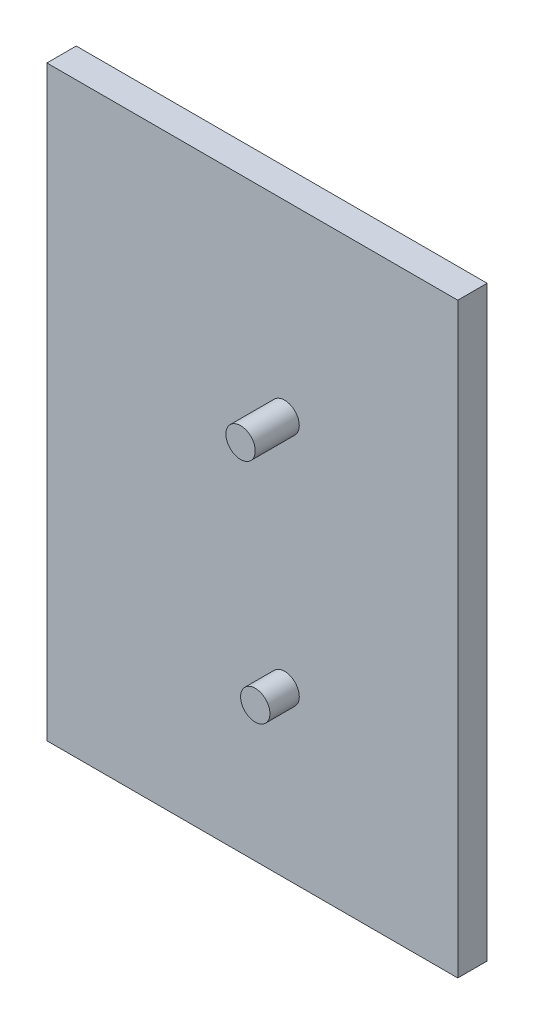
ISO-10303-21;
HEADER;
FILE_DESCRIPTION(('STEP AP214'),'2;1');
FILE_NAME('part.step','',(''),(''),'','','');
FILE_SCHEMA(('AUTOMOTIVE_DESIGN { 1 0 10303 214 1 1 1 1 }'));
ENDSEC;
DATA;
#1=APPLICATION_CONTEXT('core data for automotive mechanical design processes');
#2=APPLICATION_PROTOCOL_DEFINITION('international standard','automotive_design',2000,#1);
#3=PRODUCT_CONTEXT('',#1,'mechanical');
#4=PRODUCT('Part','Part','',(#3));
#5=PRODUCT_RELATED_PRODUCT_CATEGORY('part','',(#4));
#6=PRODUCT_DEFINITION_FORMATION('','',#4);
#7=PRODUCT_DEFINITION_CONTEXT('part definition',#1,'design');
#8=PRODUCT_DEFINITION('design','',#6,#7);
#9=PRODUCT_DEFINITION_SHAPE('','',#8);
#10=(LENGTH_UNIT() NAMED_UNIT(*) SI_UNIT(.MILLI.,.METRE.));
#11=(NAMED_UNIT(*) PLANE_ANGLE_UNIT() SI_UNIT($,.RADIAN.));
#12=(NAMED_UNIT(*) SI_UNIT($,.STERADIAN.) SOLID_ANGLE_UNIT());
#13=UNCERTAINTY_MEASURE_WITH_UNIT(LENGTH_MEASURE(1.E-05),#10,'distance_accuracy_value','');
#14=(GEOMETRIC_REPRESENTATION_CONTEXT(3) GLOBAL_UNCERTAINTY_ASSIGNED_CONTEXT((#13)) GLOBAL_UNIT_ASSIGNED_CONTEXT((#10,
#11,#12)) REPRESENTATION_CONTEXT('',''));
#15=CARTESIAN_POINT('',(0.,0.,0.));
#16=DIRECTION('',(0.,0.,1.));
#17=DIRECTION('',(1.,0.,0.));
#18=AXIS2_PLACEMENT_3D('',#15,#16,#17);
#19=CARTESIAN_POINT('',(-397.999998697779,-276.999997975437,-62.5));
#20=DIRECTION('',(0.,0.,1.));
#21=DIRECTION('',(1.,0.,0.));
#22=AXIS2_PLACEMENT_3D('',#19,#20,#21);
#23=PLANE('',#22);
#24=CARTESIAN_POINT('',(7.00001563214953,402.999993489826,-62.5));
#25=DIRECTION('',(0.,0.,1.));
#26=DIRECTION('',(1.,0.,0.));
#27=AXIS2_PLACEMENT_3D('',#24,#25,#26);
#28=CIRCLE('',#27,25.);
#29=CARTESIAN_POINT('',(32.0000156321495,402.999993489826,-62.5));
#30=VERTEX_POINT('',#29);
#31=EDGE_CURVE('E146',#30,#30,#28,.T.);
#32=ORIENTED_EDGE('',*,*,#31,.F.);
#33=EDGE_LOOP('',(#32));
#34=FACE_BOUND('',#33,.T.);
#35=DIRECTION('',(-2.10734241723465E-08,-1.,0.));
#36=VECTOR('',#35,1.);
#37=CARTESIAN_POINT('',(-397.999977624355,723.000002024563,-62.5));
#38=LINE('',#37,#36);
#39=CARTESIAN_POINT('',(-397.999977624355,723.000002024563,-62.5));
#40=VERTEX_POINT('',#39);
#41=CARTESIAN_POINT('',(-397.999998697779,-276.999997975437,-62.5));
#42=VERTEX_POINT('',#41);
#43=EDGE_CURVE('E98',#40,#42,#38,.T.);
#44=ORIENTED_EDGE('',*,*,#43,.T.);
#45=DIRECTION('',(1.,-2.10734241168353E-08,0.));
#46=VECTOR('',#45,1.);
#47=CARTESIAN_POINT('',(-397.999998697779,-276.999997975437,-62.5));
#48=LINE('',#47,#46);
#49=CARTESIAN_POINT('',(302.000001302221,-277.000012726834,-62.5));
#50=VERTEX_POINT('',#49);
#51=EDGE_CURVE('E101',#42,#50,#48,.T.);
#52=ORIENTED_EDGE('',*,*,#51,.T.);
#53=DIRECTION('',(2.10734240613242E-08,1.,0.));
#54=VECTOR('',#53,1.);
#55=CARTESIAN_POINT('',(302.000001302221,-277.000012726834,-62.5));
#56=LINE('',#55,#54);
#57=CARTESIAN_POINT('',(302.000022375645,722.999987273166,-62.5));
#58=VERTEX_POINT('',#57);
#59=EDGE_CURVE('E83',#50,#58,#56,.T.);
#60=ORIENTED_EDGE('',*,*,#59,.T.);
#61=DIRECTION('',(-1.,2.10734241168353E-08,0.));
#62=VECTOR('',#61,1.);
#63=CARTESIAN_POINT('',(302.000022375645,722.999987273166,-62.5));
#64=LINE('',#63,#62);
#65=EDGE_CURVE('E93',#58,#40,#64,.T.);
#66=ORIENTED_EDGE('',*,*,#65,.T.);
#67=EDGE_LOOP('',(#44,#52,#60,#66));
#68=FACE_BOUND('',#67,.T.);
#69=CARTESIAN_POINT('',(7.00000720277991,2.99999348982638,-62.5));
#70=DIRECTION('',(0.,0.,1.));
#71=DIRECTION('',(1.,0.,0.));
#72=AXIS2_PLACEMENT_3D('',#69,#70,#71);
#73=CIRCLE('',#72,25.);
#74=CARTESIAN_POINT('',(32.0000072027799,2.99999348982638,-62.5));
#75=VERTEX_POINT('',#74);
#76=EDGE_CURVE('E147',#75,#75,#73,.T.);
#77=ORIENTED_EDGE('',*,*,#76,.F.);
#78=EDGE_LOOP('',(#77));
#79=FACE_BOUND('',#78,.T.);
#80=ADVANCED_FACE('F32',(#34,#68,#79),#23,.T.);
#81=CARTESIAN_POINT('',(-397.999977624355,723.000002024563,-112.5));
#82=DIRECTION('',(-1.,2.10734241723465E-08,0.));
#83=DIRECTION('',(-2.10734241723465E-08,-1.,0.));
#84=AXIS2_PLACEMENT_3D('',#81,#82,#83);
#85=PLANE('',#84);
#86=ORIENTED_EDGE('',*,*,#43,.F.);
#87=DIRECTION('',(0.,0.,1.));
#88=VECTOR('',#87,1.);
#89=CARTESIAN_POINT('',(-397.999977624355,723.000002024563,-112.5));
#90=LINE('',#89,#88);
#91=CARTESIAN_POINT('',(-397.999977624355,723.000002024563,-112.5));
#92=VERTEX_POINT('',#91);
#93=EDGE_CURVE('E11',#92,#40,#90,.T.);
#94=ORIENTED_EDGE('',*,*,#93,.F.);
#95=DIRECTION('',(-2.10734241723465E-08,-1.,0.));
#96=VECTOR('',#95,1.);
#97=CARTESIAN_POINT('',(-397.999977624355,723.000002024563,-112.5));
#98=LINE('',#97,#96);
#99=CARTESIAN_POINT('',(-397.999998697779,-276.999997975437,-112.5));
#100=VERTEX_POINT('',#99);
#101=EDGE_CURVE('E91',#92,#100,#98,.T.);
#102=ORIENTED_EDGE('',*,*,#101,.T.);
#103=DIRECTION('',(0.,0.,1.));
#104=VECTOR('',#103,1.);
#105=CARTESIAN_POINT('',(-397.999998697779,-276.999997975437,-112.5));
#106=LINE('',#105,#104);
#107=EDGE_CURVE('E36',#100,#42,#106,.T.);
#108=ORIENTED_EDGE('',*,*,#107,.T.);
#109=EDGE_LOOP('',(#86,#94,#102,#108));
#110=FACE_BOUND('',#109,.T.);
#111=ADVANCED_FACE('F34',(#110),#85,.T.);
#112=CARTESIAN_POINT('',(302.000022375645,722.999987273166,-112.5));
#113=DIRECTION('',(2.10734241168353E-08,1.,0.));
#114=DIRECTION('',(-1.,2.10734241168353E-08,0.));
#115=AXIS2_PLACEMENT_3D('',#112,#113,#114);
#116=PLANE('',#115);
#117=ORIENTED_EDGE('',*,*,#65,.F.);
#118=DIRECTION('',(0.,0.,1.));
#119=VECTOR('',#118,1.);
#120=CARTESIAN_POINT('',(302.000022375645,722.999987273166,-112.5));
#121=LINE('',#120,#119);
#122=CARTESIAN_POINT('',(302.000022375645,722.999987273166,-112.5));
#123=VERTEX_POINT('',#122);
#124=EDGE_CURVE('E42',#123,#58,#121,.T.);
#125=ORIENTED_EDGE('',*,*,#124,.F.);
#126=DIRECTION('',(-1.,2.10734241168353E-08,0.));
#127=VECTOR('',#126,1.);
#128=CARTESIAN_POINT('',(302.000022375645,722.999987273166,-112.5));
#129=LINE('',#128,#127);
#130=EDGE_CURVE('E88',#123,#92,#129,.T.);
#131=ORIENTED_EDGE('',*,*,#130,.T.);
#132=ORIENTED_EDGE('',*,*,#93,.T.);
#133=EDGE_LOOP('',(#117,#125,#131,#132));
#134=FACE_BOUND('',#133,.T.);
#135=ADVANCED_FACE('F109',(#134),#116,.T.);
#136=CARTESIAN_POINT('',(302.000001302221,-277.000012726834,-112.5));
#137=DIRECTION('',(1.,-2.10734240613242E-08,0.));
#138=DIRECTION('',(2.10734240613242E-08,1.,0.));
#139=AXIS2_PLACEMENT_3D('',#136,#137,#138);
#140=PLANE('',#139);
#141=ORIENTED_EDGE('',*,*,#59,.F.);
#142=DIRECTION('',(0.,0.,1.));
#143=VECTOR('',#142,1.);
#144=CARTESIAN_POINT('',(302.000001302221,-277.000012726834,-112.5));
#145=LINE('',#144,#143);
#146=CARTESIAN_POINT('',(302.000001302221,-277.000012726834,-112.5));
#147=VERTEX_POINT('',#146);
#148=EDGE_CURVE('E78',#147,#50,#145,.T.);
#149=ORIENTED_EDGE('',*,*,#148,.F.);
#150=DIRECTION('',(2.10734240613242E-08,1.,0.));
#151=VECTOR('',#150,1.);
#152=CARTESIAN_POINT('',(302.000001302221,-277.000012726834,-112.5));
#153=LINE('',#152,#151);
#154=EDGE_CURVE('E81',#147,#123,#153,.T.);
#155=ORIENTED_EDGE('',*,*,#154,.T.);
#156=ORIENTED_EDGE('',*,*,#124,.T.);
#157=EDGE_LOOP('',(#141,#149,#155,#156));
#158=FACE_BOUND('',#157,.T.);
#159=ADVANCED_FACE('F80',(#158),#140,.T.);
#160=CARTESIAN_POINT('',(-397.999998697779,-276.999997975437,-112.5));
#161=DIRECTION('',(-2.10734241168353E-08,-1.,0.));
#162=DIRECTION('',(1.,-2.10734241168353E-08,0.));
#163=AXIS2_PLACEMENT_3D('',#160,#161,#162);
#164=PLANE('',#163);
#165=ORIENTED_EDGE('',*,*,#51,.F.);
#166=ORIENTED_EDGE('',*,*,#107,.F.);
#167=DIRECTION('',(1.,-2.10734241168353E-08,0.));
#168=VECTOR('',#167,1.);
#169=CARTESIAN_POINT('',(-397.999998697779,-276.999997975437,-112.5));
#170=LINE('',#169,#168);
#171=EDGE_CURVE('E87',#100,#147,#170,.T.);
#172=ORIENTED_EDGE('',*,*,#171,.T.);
#173=ORIENTED_EDGE('',*,*,#148,.T.);
#174=EDGE_LOOP('',(#165,#166,#172,#173));
#175=FACE_BOUND('',#174,.T.);
#176=ADVANCED_FACE('F90',(#175),#164,.T.);
#177=CARTESIAN_POINT('',(-397.999998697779,-276.999997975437,-112.5));
#178=DIRECTION('',(0.,0.,1.));
#179=DIRECTION('',(1.,0.,0.));
#180=AXIS2_PLACEMENT_3D('',#177,#178,#179);
#181=PLANE('',#180);
#182=ORIENTED_EDGE('',*,*,#101,.F.);
#183=ORIENTED_EDGE('',*,*,#130,.F.);
#184=ORIENTED_EDGE('',*,*,#154,.F.);
#185=ORIENTED_EDGE('',*,*,#171,.F.);
#186=EDGE_LOOP('',(#182,#183,#184,#185));
#187=FACE_BOUND('',#186,.T.);
#188=ADVANCED_FACE('F86',(#187),#181,.F.);
#189=CARTESIAN_POINT('',(7.00001563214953,402.999993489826,12.5));
#190=DIRECTION('',(0.,0.,-1.));
#191=DIRECTION('',(-1.,0.,0.));
#192=AXIS2_PLACEMENT_3D('',#189,#190,#191);
#193=CYLINDRICAL_SURFACE('',#192,25.);
#194=CARTESIAN_POINT('',(7.00001563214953,402.999993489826,12.5));
#195=DIRECTION('',(0.,0.,1.));
#196=DIRECTION('',(1.,0.,0.));
#197=AXIS2_PLACEMENT_3D('',#194,#195,#196);
#198=CIRCLE('',#197,25.);
#199=CARTESIAN_POINT('',(32.0000156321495,402.999993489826,12.5));
#200=VERTEX_POINT('',#199);
#201=EDGE_CURVE('E102',#200,#200,#198,.T.);
#202=ORIENTED_EDGE('',*,*,#201,.F.);
#203=EDGE_LOOP('',(#202));
#204=FACE_BOUND('',#203,.T.);
#205=ORIENTED_EDGE('',*,*,#31,.T.);
#206=EDGE_LOOP('',(#205));
#207=FACE_BOUND('',#206,.T.);
#208=ADVANCED_FACE('F126',(#204,#207),#193,.T.);
#209=CARTESIAN_POINT('',(7.00001563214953,402.999993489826,12.5));
#210=DIRECTION('',(0.,0.,1.));
#211=DIRECTION('',(1.,0.,0.));
#212=AXIS2_PLACEMENT_3D('',#209,#210,#211);
#213=PLANE('',#212);
#214=ORIENTED_EDGE('',*,*,#201,.T.);
#215=EDGE_LOOP('',(#214));
#216=FACE_BOUND('',#215,.T.);
#217=ADVANCED_FACE('F129',(#216),#213,.T.);
#218=CARTESIAN_POINT('',(7.00000720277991,2.99999348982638,-12.5));
#219=DIRECTION('',(0.,0.,-1.));
#220=DIRECTION('',(-1.,0.,0.));
#221=AXIS2_PLACEMENT_3D('',#218,#219,#220);
#222=CYLINDRICAL_SURFACE('',#221,25.);
#223=CARTESIAN_POINT('',(7.00000720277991,2.99999348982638,-12.5));
#224=DIRECTION('',(0.,0.,1.));
#225=DIRECTION('',(1.,0.,0.));
#226=AXIS2_PLACEMENT_3D('',#223,#224,#225);
#227=CIRCLE('',#226,25.);
#228=CARTESIAN_POINT('',(32.0000072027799,2.99999348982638,-12.5));
#229=VERTEX_POINT('',#228);
#230=EDGE_CURVE('E145',#229,#229,#227,.T.);
#231=ORIENTED_EDGE('',*,*,#230,.F.);
#232=EDGE_LOOP('',(#231));
#233=FACE_BOUND('',#232,.T.);
#234=ORIENTED_EDGE('',*,*,#76,.T.);
#235=EDGE_LOOP('',(#234));
#236=FACE_BOUND('',#235,.T.);
#237=ADVANCED_FACE('F133',(#233,#236),#222,.T.);
#238=CARTESIAN_POINT('',(7.00000720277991,2.99999348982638,-12.5));
#239=DIRECTION('',(0.,0.,1.));
#240=DIRECTION('',(1.,0.,0.));
#241=AXIS2_PLACEMENT_3D('',#238,#239,#240);
#242=PLANE('',#241);
#243=ORIENTED_EDGE('',*,*,#230,.T.);
#244=EDGE_LOOP('',(#243));
#245=FACE_BOUND('',#244,.T.);
#246=ADVANCED_FACE('F137',(#245),#242,.T.);
#247=CLOSED_SHELL('',(#80,#111,#135,#159,#176,#188,#208,#217,#237,#246));
#248=MANIFOLD_SOLID_BREP('B2',#247);
#249=ADVANCED_BREP_SHAPE_REPRESENTATION('',(#18,#248),#14);
#250=SHAPE_DEFINITION_REPRESENTATION(#9,#249);
ENDSEC;
END-ISO-10303-21;
